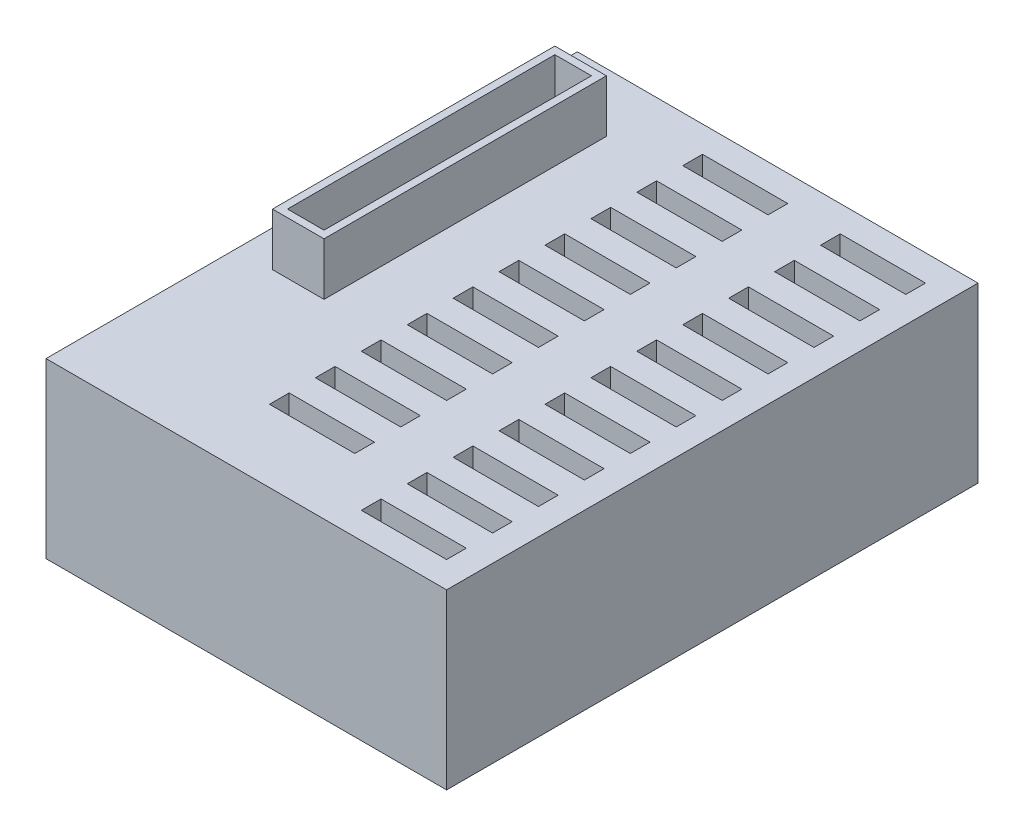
from build123d import *

# Parameters (mm, degrees)
SKETCH1_W           = 150
SKETCH1_H           = 211.5
BOSS_EXTRUDE1_DEPTH = 66.04
SKETCH3_W           = 32.5
SKETCH3_H           = 7.5
CUT_EXTRUDE1_DEPTH  = 10
SKETCH9_W           = 211.5
SKETCH9_H           = 66.04
BOSS_EXTRUDE4_DEPTH = 2.667
SKETCH10_W          = 152.667
SKETCH10_H          = 3.5
CUT_EXTRUDE3_DEPTH  = 184.145100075
SKETCH11_W          = 142.667
SKETCH11_H          = 198
CUT_EXTRUDE4_DEPTH  = 48
SKETCH13_W          = 152.667
SKETCH13_H          = 5.5
CUT_EXTRUDE6_DEPTH  = 184.145100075
SKETCH15_W          = 142.667
SKETCH15_H          = 5
BOSS_EXTRUDE6_DEPTH = 48
SKETCH16_R          = 1.35
CUT_EXTRUDE7_DEPTH  = 10
SKETCH17_W          = 19.64
SKETCH17_H          = 107.6
SKETCH17_W_2        = 13.94
SKETCH17_H_2        = 101.9
BOSS_EXTRUDE7_DEPTH = 20


with BuildPart() as part:
    # Sketch1 → Boss-Extrude1 (new body)
    with BuildSketch(Plane(origin=(0, 0, 0), x_dir=(1, 0, 0), z_dir=(0, 1, 0))):
        with Locations((-30.79316888, -26.224383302)):
            Rectangle(SKETCH1_W, SKETCH1_H)
    extrude(amount=-BOSS_EXTRUDE1_DEPTH)

    # Sketch3 → Cut-Extrude1 (cut)
    with BuildSketch(Plane(origin=(0, 0, 0), x_dir=(1, 0, 0), z_dir=(0, 1, 0))):
        with Locations((17.95683112, -118.224383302)):
            Rectangle(SKETCH3_W, SKETCH3_H)
        with Locations((-34.54316888, -100.724383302)):
            Rectangle(SKETCH3_W, SKETCH3_H)
        with Locations((-34.54316888, -83.224383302)):
            Rectangle(SKETCH3_W, SKETCH3_H)
        with Locations((-34.54316888, -65.724383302)):
            Rectangle(SKETCH3_W, SKETCH3_H)
        with Locations((-34.54316888, -48.224383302)):
            Rectangle(SKETCH3_W, SKETCH3_H)
        with Locations((-34.54316888, -30.724383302)):
            Rectangle(SKETCH3_W, SKETCH3_H)
        with Locations((-34.54316888, -13.224383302)):
            Rectangle(SKETCH3_W, SKETCH3_H)
        with Locations((-34.54316888, 4.275616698)):
            Rectangle(SKETCH3_W, SKETCH3_H)
        with Locations((-34.54316888, 21.775616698)):
            Rectangle(SKETCH3_W, SKETCH3_H)
        with Locations((-34.54316888, 39.275616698)):
            Rectangle(SKETCH3_W, SKETCH3_H)
        with Locations((-34.54316888, 56.775616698)):
            Rectangle(SKETCH3_W, SKETCH3_H)
        with Locations((17.95683112, -100.724383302)):
            Rectangle(SKETCH3_W, SKETCH3_H)
        with Locations((17.95683112, -83.224383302)):
            Rectangle(SKETCH3_W, SKETCH3_H)
        with Locations((17.95683112, -65.724383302)):
            Rectangle(SKETCH3_W, SKETCH3_H)
        with Locations((17.95683112, -48.224383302)):
            Rectangle(SKETCH3_W, SKETCH3_H)
        with Locations((17.95683112, -30.724383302)):
            Rectangle(SKETCH3_W, SKETCH3_H)
        with Locations((17.95683112, -13.224383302)):
            Rectangle(SKETCH3_W, SKETCH3_H)
        with Locations((17.95683112, 4.275616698)):
            Rectangle(SKETCH3_W, SKETCH3_H)
        with Locations((17.95683112, 21.775616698)):
            Rectangle(SKETCH3_W, SKETCH3_H)
        with Locations((17.95683112, 39.275616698)):
            Rectangle(SKETCH3_W, SKETCH3_H)
        with Locations((17.95683112, 56.775616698)):
            Rectangle(SKETCH3_W, SKETCH3_H)
    extrude(amount=-CUT_EXTRUDE1_DEPTH, mode=Mode.SUBTRACT)

    # Sketch9 → Boss-Extrude4 (add)
    with BuildSketch(Plane.ZY.offset(105.79316888)):
        with Locations((26.224383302, -33.02)):
            Rectangle(SKETCH9_W, SKETCH9_H)
    extrude(amount=BOSS_EXTRUDE4_DEPTH)

    # Sketch10 → Cut-Extrude3 (cut, through all)
    with BuildSketch(Plane(origin=(0, 0, 0), x_dir=(1, 0, 0), z_dir=(0, 1, 0))):
        with Locations((-32.12666888, 77.775616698)):
            Rectangle(SKETCH10_W, SKETCH10_H)
    extrude(amount=-CUT_EXTRUDE3_DEPTH, mode=Mode.SUBTRACT)

    # Sketch11 → Cut-Extrude4 (cut)
    with BuildSketch(Plane.XZ.offset(66.04)):
        with Locations((-32.12666888, 27.974383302)):
            Rectangle(SKETCH11_W, SKETCH11_H)
    extrude(amount=-CUT_EXTRUDE4_DEPTH, mode=Mode.SUBTRACT)

    # Sketch13 → Cut-Extrude6 (cut, through all)
    with BuildSketch(Plane(origin=(0, 0, 0), x_dir=(1, 0, 0), z_dir=(0, 1, 0))):
        with Locations((-32.12666888, 73.275616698)):
            Rectangle(SKETCH13_W, SKETCH13_H)
    extrude(amount=-CUT_EXTRUDE6_DEPTH, mode=Mode.SUBTRACT)

    # Sketch15 → Boss-Extrude6 (add)
    with BuildSketch(Plane.XZ.offset(18.04)):
        with Locations((-32.12666888, -68.025616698)):
            Rectangle(SKETCH15_W, SKETCH15_H)
    extrude(amount=BOSS_EXTRUDE6_DEPTH)

    # Sketch16 → Cut-Extrude7 (cut)
    with BuildSketch(Plane.ZY.offset(108.46016888)):
        with Locations((-4.875616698, -6)):
            Circle(SKETCH16_R)
        with Locations((66.324383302, -6)):
            Circle(SKETCH16_R)
    extrude(amount=-CUT_EXTRUDE7_DEPTH, mode=Mode.SUBTRACT)

    # Sketch17 → Boss-Extrude7 (add)
    with BuildSketch(Plane(origin=(0, 0, 0), x_dir=(1, 0, 0), z_dir=(0, 1, 0))):
        with Locations((-84.82496888, -5.674383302)):
            Rectangle(SKETCH17_W, SKETCH17_H)
        with Locations((-84.82496888, -5.674383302)):
            Rectangle(SKETCH17_W_2, SKETCH17_H_2, mode=Mode.SUBTRACT)
    extrude(amount=BOSS_EXTRUDE7_DEPTH)


solid = part.part
